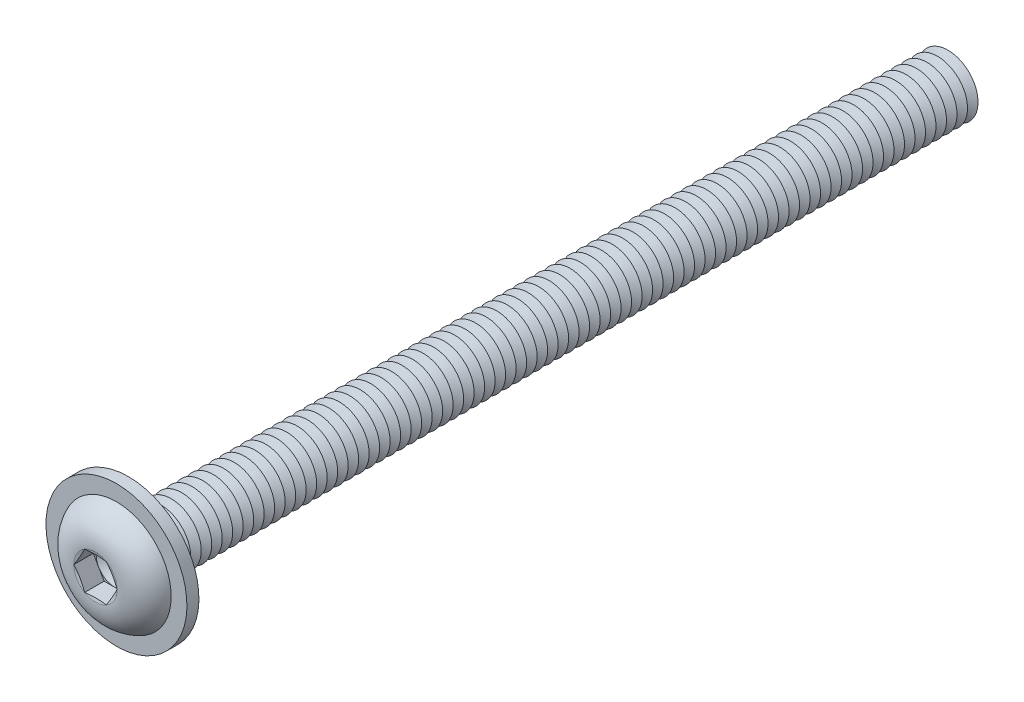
from build123d import *

# Parameters (mm, degrees)
FILLET1_R           = 0.35
LPATTERN1_COUNT     = 78
LPATTERN1_PITCH     = 0.7
CUT_EXTRUDE1_DEPTH  = 1.3
SKETCH5_R           = 4.7
SKETCH5_R_2         = 2.35
BOSS_EXTRUDE1_DEPTH = 0.8


with BuildPart() as part:
    # Sketch1 → Revolve1 (revolve)
    with BuildSketch(Plane(origin=(0, 0, 0), x_dir=(0, 0, -1), z_dir=(1, 0, 0))):
        with BuildLine():
            Line((0, 2), (0, 3.8))
            ThreePointArc((0, 3.8), (-1.611961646, 3.099623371), (-2.2, 1.443375))
            Line((-2.2, 1.443375), (-2.006624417, 0.7216875))
            Line((-2.006624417, 0.7216875), (-2.2, 0.7216875))
            Line((-2.2, 0.7216875), (-2.2, 0))
            Line((-2.2, 0), (55, 0))
            Line((55, 0), (55, 2))
            Line((55, 2), (0, 2))
        make_face()
    revolve(axis=Axis((0, 0, -55), (0, 0, 1)))

    # Fillet1
    fillet1_edges = [part.edges().sort_by_distance(p)[0] for p in [
        (0, -2, 0),
    ]]
    fillet(fillet1_edges, radius=FILLET1_R)

    # Sketch2 → Cut-Revolve1 (revolve, cut)
    with BuildSketch(Plane(origin=(0, 0, 0), x_dir=(0, 0, -1), z_dir=(1, 0, 0))):
        Polygon((54.65, 2), (55.35, 2), (55, 1.393782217), align=None)
    cut_revolve1 = revolve(axis=Axis((0, 0, -55), (0, 0, -1)), mode=Mode.SUBTRACT)

    # LPattern1: Cut-Revolve1 ×78
    with Locations(*[(0, 0, i * LPATTERN1_PITCH) for i in range(1, LPATTERN1_COUNT)]):
        add(cut_revolve1, mode=Mode.SUBTRACT)

    # Sketch3 → Cut-Extrude1 (cut)
    with BuildSketch(Plane.XY.offset(2.2)):
        Polygon((0.7216875, 1.249999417), (-0.7216875, 1.249999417), (-1.443375, 0), (-0.7216875, -1.249999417), (0.7216875, -1.249999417), (1.443375, 0), align=None)
    extrude(amount=-CUT_EXTRUDE1_DEPTH, mode=Mode.SUBTRACT)

    # Cut-Extrude2 cone 1 section (on through the dimple's axis) → Cut-Extrude2 (revolve, cut)
    with BuildSketch(Plane(origin=(0, 0, 0.9), x_dir=(0, -1, 0), z_dir=(1, 0, 0))):
        Polygon((0, 0), (1.249999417, 0), (0, 0.7216875), align=None)
    revolve(axis=Axis((0, 0, 0.9), (0, 0, -1)), mode=Mode.SUBTRACT)

    # Sketch5 → Boss-Extrude1 (add)
    with BuildSketch(Plane(origin=(0, 0, 0), x_dir=(-1, 0, 0), z_dir=(0, 0, -1))):
        with Locations(Location((0, 0, 0), (0, 0, 90))):
            Circle(SKETCH5_R)
        Circle(SKETCH5_R_2, mode=Mode.SUBTRACT)
    extrude(amount=-BOSS_EXTRUDE1_DEPTH)


solid = part.part
